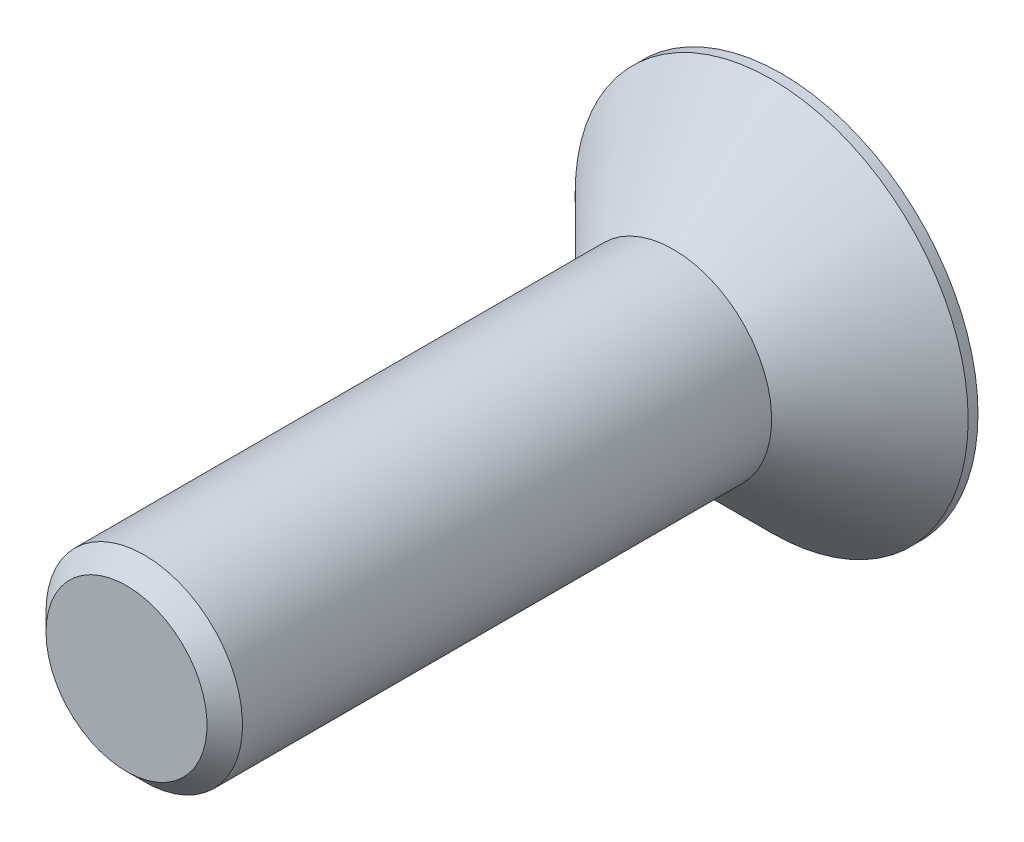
ISO-10303-21;
HEADER;
FILE_DESCRIPTION(('STEP AP214'),'2;1');
FILE_NAME('part.step','',(''),(''),'','','');
FILE_SCHEMA(('AUTOMOTIVE_DESIGN { 1 0 10303 214 1 1 1 1 }'));
ENDSEC;
DATA;
#1=APPLICATION_CONTEXT('core data for automotive mechanical design processes');
#2=APPLICATION_PROTOCOL_DEFINITION('international standard','automotive_design',2000,#1);
#3=PRODUCT_CONTEXT('',#1,'mechanical');
#4=PRODUCT('Part','Part','',(#3));
#5=PRODUCT_RELATED_PRODUCT_CATEGORY('part','',(#4));
#6=PRODUCT_DEFINITION_FORMATION('','',#4);
#7=PRODUCT_DEFINITION_CONTEXT('part definition',#1,'design');
#8=PRODUCT_DEFINITION('design','',#6,#7);
#9=PRODUCT_DEFINITION_SHAPE('','',#8);
#10=(LENGTH_UNIT() NAMED_UNIT(*) SI_UNIT(.MILLI.,.METRE.));
#11=(NAMED_UNIT(*) PLANE_ANGLE_UNIT() SI_UNIT($,.RADIAN.));
#12=(NAMED_UNIT(*) SI_UNIT($,.STERADIAN.) SOLID_ANGLE_UNIT());
#13=UNCERTAINTY_MEASURE_WITH_UNIT(LENGTH_MEASURE(1.E-05),#10,'distance_accuracy_value','');
#14=(GEOMETRIC_REPRESENTATION_CONTEXT(3) GLOBAL_UNCERTAINTY_ASSIGNED_CONTEXT((#13)) GLOBAL_UNIT_ASSIGNED_CONTEXT((#10,
#11,#12)) REPRESENTATION_CONTEXT('',''));
#15=CARTESIAN_POINT('',(0.,0.,0.));
#16=DIRECTION('',(0.,0.,1.));
#17=DIRECTION('',(1.,0.,0.));
#18=AXIS2_PLACEMENT_3D('',#15,#16,#17);
#19=CARTESIAN_POINT('',(0.,-2.45849999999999,20.));
#20=DIRECTION('',(0.,0.,-1.));
#21=DIRECTION('',(0.,1.,0.));
#22=AXIS2_PLACEMENT_3D('',#19,#20,#21);
#23=PLANE('',#22);
#24=CARTESIAN_POINT('',(0.,0.,19.9999999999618));
#25=DIRECTION('',(0.,0.,-1.));
#26=DIRECTION('',(-1.,0.,0.));
#27=AXIS2_PLACEMENT_3D('',#24,#25,#26);
#28=CIRCLE('',#27,2.45850000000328);
#29=CARTESIAN_POINT('',(-2.45850000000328,0.,19.9999999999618));
#30=VERTEX_POINT('',#29);
#31=EDGE_CURVE('E20',#30,#30,#28,.T.);
#32=ORIENTED_EDGE('',*,*,#31,.F.);
#33=EDGE_LOOP('',(#32));
#34=FACE_BOUND('',#33,.T.);
#35=ADVANCED_FACE('F16',(#34),#23,.F.);
#36=CARTESIAN_POINT('',(0.,0.,19.4585000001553));
#37=DIRECTION('',(0.,0.,-1.));
#38=DIRECTION('',(-1.,0.,0.));
#39=AXIS2_PLACEMENT_3D('',#36,#37,#38);
#40=CONICAL_SURFACE('',#39,2.99999999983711,0.785398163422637);
#41=ORIENTED_EDGE('',*,*,#31,.T.);
#42=EDGE_LOOP('',(#41));
#43=FACE_BOUND('',#42,.T.);
#44=CARTESIAN_POINT('',(0.,0.,19.4585));
#45=DIRECTION('',(0.,0.,-1.));
#46=DIRECTION('',(0.,1.,0.));
#47=AXIS2_PLACEMENT_3D('',#44,#45,#46);
#48=CIRCLE('',#47,3.);
#49=CARTESIAN_POINT('',(0.,3.00000000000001,19.4585));
#50=VERTEX_POINT('',#49);
#51=EDGE_CURVE('E129',#50,#50,#48,.T.);
#52=ORIENTED_EDGE('',*,*,#51,.F.);
#53=EDGE_LOOP('',(#52));
#54=FACE_BOUND('',#53,.T.);
#55=ADVANCED_FACE('F190',(#43,#54),#40,.T.);
#56=CARTESIAN_POINT('',(0.,0.,10.));
#57=DIRECTION('',(0.,0.,-1.));
#58=DIRECTION('',(0.,1.,0.));
#59=AXIS2_PLACEMENT_3D('',#56,#57,#58);
#60=CYLINDRICAL_SURFACE('',#59,3.);
#61=ORIENTED_EDGE('',*,*,#51,.T.);
#62=EDGE_LOOP('',(#61));
#63=FACE_BOUND('',#62,.T.);
#64=CARTESIAN_POINT('',(0.,0.,3.30000000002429));
#65=DIRECTION('',(0.,0.,-1.));
#66=DIRECTION('',(-0.479425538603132,-0.877582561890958,0.));
#67=AXIS2_PLACEMENT_3D('',#64,#65,#66);
#68=CIRCLE('',#67,3.00000000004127);
#69=CARTESIAN_POINT('',(-1.4382766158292,-2.63274768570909,3.3000000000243));
#70=VERTEX_POINT('',#69);
#71=EDGE_CURVE('E126',#70,#70,#68,.T.);
#72=ORIENTED_EDGE('',*,*,#71,.F.);
#73=EDGE_LOOP('',(#72));
#74=FACE_BOUND('',#73,.T.);
#75=ADVANCED_FACE('F186',(#63,#74),#60,.T.);
#76=CARTESIAN_POINT('',(0.,0.,0.299999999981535));
#77=DIRECTION('',(0.,0.,-1.));
#78=DIRECTION('',(0.,1.,0.));
#79=AXIS2_PLACEMENT_3D('',#76,#77,#78);
#80=CONICAL_SURFACE('',#79,6.00000000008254,0.785398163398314);
#81=ORIENTED_EDGE('',*,*,#71,.T.);
#82=EDGE_LOOP('',(#81));
#83=FACE_BOUND('',#82,.T.);
#84=CARTESIAN_POINT('',(0.,0.,0.299999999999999));
#85=DIRECTION('',(0.,0.,-1.));
#86=DIRECTION('',(0.,1.,0.));
#87=AXIS2_PLACEMENT_3D('',#84,#85,#86);
#88=CIRCLE('',#87,6.);
#89=CARTESIAN_POINT('',(0.,6.,0.299999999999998));
#90=VERTEX_POINT('',#89);
#91=EDGE_CURVE('E83',#90,#90,#88,.T.);
#92=ORIENTED_EDGE('',*,*,#91,.F.);
#93=EDGE_LOOP('',(#92));
#94=FACE_BOUND('',#93,.T.);
#95=ADVANCED_FACE('F145',(#83,#94),#80,.T.);
#96=CARTESIAN_POINT('',(0.,0.,2.8));
#97=DIRECTION('',(0.,0.,-1.));
#98=DIRECTION('',(0.,1.,0.));
#99=AXIS2_PLACEMENT_3D('',#96,#97,#98);
#100=PLANE('',#99);
#101=DIRECTION('',(0.50000000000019,-0.866025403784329,0.));
#102=VECTOR('',#101,1.);
#103=CARTESIAN_POINT('',(1.15470053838,2.00000000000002,2.79999999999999));
#104=LINE('',#103,#102);
#105=CARTESIAN_POINT('',(2.30940107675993,0.,2.79999999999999));
#106=VERTEX_POINT('',#105);
#107=CARTESIAN_POINT('',(1.15470053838,2.00000000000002,2.79999999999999));
#108=VERTEX_POINT('',#107);
#109=EDGE_CURVE('E74',#106,#108,#104,.F.);
#110=ORIENTED_EDGE('',*,*,#109,.F.);
#111=DIRECTION('',(-0.50000000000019,-0.866025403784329,0.));
#112=VECTOR('',#111,1.);
#113=CARTESIAN_POINT('',(2.30940107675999,0.,2.79999999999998));
#114=LINE('',#113,#112);
#115=CARTESIAN_POINT('',(1.15470053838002,-2.00000000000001,2.79999999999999));
#116=VERTEX_POINT('',#115);
#117=EDGE_CURVE('E109',#116,#106,#114,.F.);
#118=ORIENTED_EDGE('',*,*,#117,.F.);
#119=DIRECTION('',(1.,0.,0.));
#120=VECTOR('',#119,1.);
#121=CARTESIAN_POINT('',(1.15470053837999,-2.,2.79999999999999));
#122=LINE('',#121,#120);
#123=CARTESIAN_POINT('',(-1.15470053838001,-1.99999999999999,2.79999999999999));
#124=VERTEX_POINT('',#123);
#125=EDGE_CURVE('E59',#124,#116,#122,.T.);
#126=ORIENTED_EDGE('',*,*,#125,.F.);
#127=DIRECTION('',(-0.50000000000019,0.866025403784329,0.));
#128=VECTOR('',#127,1.);
#129=CARTESIAN_POINT('',(-1.15470053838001,-1.99999999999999,2.79999999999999));
#130=LINE('',#129,#128);
#131=CARTESIAN_POINT('',(-2.30940107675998,0.,2.80000000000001));
#132=VERTEX_POINT('',#131);
#133=EDGE_CURVE('E102',#132,#124,#130,.F.);
#134=ORIENTED_EDGE('',*,*,#133,.F.);
#135=DIRECTION('',(0.50000000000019,0.866025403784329,0.));
#136=VECTOR('',#135,1.);
#137=CARTESIAN_POINT('',(-2.30940107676,0.,2.79999999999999));
#138=LINE('',#137,#136);
#139=CARTESIAN_POINT('',(-1.15470053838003,2.00000000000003,2.79999999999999));
#140=VERTEX_POINT('',#139);
#141=EDGE_CURVE('E89',#140,#132,#138,.F.);
#142=ORIENTED_EDGE('',*,*,#141,.F.);
#143=DIRECTION('',(1.,0.,0.));
#144=VECTOR('',#143,1.);
#145=CARTESIAN_POINT('',(-1.15470053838,2.00000000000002,2.79999999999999));
#146=LINE('',#145,#144);
#147=EDGE_CURVE('E86',#108,#140,#146,.F.);
#148=ORIENTED_EDGE('',*,*,#147,.F.);
#149=EDGE_LOOP('',(#110,#118,#126,#134,#142,#148));
#150=FACE_BOUND('',#149,.T.);
#151=ADVANCED_FACE('F87',(#150),#100,.T.);
#152=CARTESIAN_POINT('',(0.,0.,10.));
#153=DIRECTION('',(0.,0.,-1.));
#154=DIRECTION('',(0.,1.,0.));
#155=AXIS2_PLACEMENT_3D('',#152,#153,#154);
#156=CYLINDRICAL_SURFACE('',#155,6.);
#157=ORIENTED_EDGE('',*,*,#91,.T.);
#158=EDGE_LOOP('',(#157));
#159=FACE_BOUND('',#158,.T.);
#160=CARTESIAN_POINT('',(0.,0.,0.));
#161=DIRECTION('',(0.,0.,-1.));
#162=DIRECTION('',(0.,1.,0.));
#163=AXIS2_PLACEMENT_3D('',#160,#161,#162);
#164=CIRCLE('',#163,6.);
#165=CARTESIAN_POINT('',(0.,6.,0.));
#166=VERTEX_POINT('',#165);
#167=EDGE_CURVE('E111',#166,#166,#164,.T.);
#168=ORIENTED_EDGE('',*,*,#167,.F.);
#169=EDGE_LOOP('',(#168));
#170=FACE_BOUND('',#169,.T.);
#171=ADVANCED_FACE('F135',(#159,#170),#156,.T.);
#172=CARTESIAN_POINT('',(1.15470053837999,2.00000000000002,0.));
#173=DIRECTION('',(-0.866025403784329,-0.50000000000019,0.));
#174=DIRECTION('',(0.50000000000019,-0.866025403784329,0.));
#175=AXIS2_PLACEMENT_3D('',#172,#173,#174);
#176=PLANE('',#175);
#177=DIRECTION('',(0.,0.,1.));
#178=VECTOR('',#177,1.);
#179=CARTESIAN_POINT('',(2.30940107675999,0.,0.));
#180=LINE('',#179,#178);
#181=CARTESIAN_POINT('',(2.30940107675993,0.,0.));
#182=VERTEX_POINT('',#181);
#183=EDGE_CURVE('E80',#106,#182,#180,.F.);
#184=ORIENTED_EDGE('',*,*,#183,.F.);
#185=ORIENTED_EDGE('',*,*,#109,.T.);
#186=DIRECTION('',(0.,0.,-1.));
#187=VECTOR('',#186,1.);
#188=CARTESIAN_POINT('',(1.15470053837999,2.00000000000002,0.));
#189=LINE('',#188,#187);
#190=CARTESIAN_POINT('',(1.15470053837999,2.00000000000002,0.));
#191=VERTEX_POINT('',#190);
#192=EDGE_CURVE('E78',#191,#108,#189,.F.);
#193=ORIENTED_EDGE('',*,*,#192,.F.);
#194=DIRECTION('',(-0.500000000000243,0.866025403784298,0.));
#195=VECTOR('',#194,1.);
#196=CARTESIAN_POINT('',(2.30940107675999,0.,0.));
#197=LINE('',#196,#195);
#198=EDGE_CURVE('E55',#182,#191,#197,.T.);
#199=ORIENTED_EDGE('',*,*,#198,.F.);
#200=EDGE_LOOP('',(#184,#185,#193,#199));
#201=FACE_BOUND('',#200,.T.);
#202=ADVANCED_FACE('F76',(#201),#176,.T.);
#203=CARTESIAN_POINT('',(-1.15470053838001,2.00000000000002,0.));
#204=DIRECTION('',(0.,-1.,0.));
#205=DIRECTION('',(0.,0.,-1.));
#206=AXIS2_PLACEMENT_3D('',#203,#204,#205);
#207=PLANE('',#206);
#208=ORIENTED_EDGE('',*,*,#192,.T.);
#209=ORIENTED_EDGE('',*,*,#147,.T.);
#210=DIRECTION('',(0.,0.,1.));
#211=VECTOR('',#210,1.);
#212=CARTESIAN_POINT('',(-1.15470053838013,2.00000000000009,0.));
#213=LINE('',#212,#211);
#214=CARTESIAN_POINT('',(-1.15470053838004,2.00000000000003,0.));
#215=VERTEX_POINT('',#214);
#216=EDGE_CURVE('E92',#215,#140,#213,.T.);
#217=ORIENTED_EDGE('',*,*,#216,.F.);
#218=DIRECTION('',(1.,0.,0.));
#219=VECTOR('',#218,1.);
#220=CARTESIAN_POINT('',(0.,2.00000000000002,0.));
#221=LINE('',#220,#219);
#222=EDGE_CURVE('E96',#191,#215,#221,.F.);
#223=ORIENTED_EDGE('',*,*,#222,.F.);
#224=EDGE_LOOP('',(#208,#209,#217,#223));
#225=FACE_BOUND('',#224,.T.);
#226=ADVANCED_FACE('F94',(#225),#207,.T.);
#227=CARTESIAN_POINT('',(-2.30940107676,0.,0.));
#228=DIRECTION('',(0.866025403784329,-0.50000000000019,0.));
#229=DIRECTION('',(0.50000000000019,0.866025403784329,0.));
#230=AXIS2_PLACEMENT_3D('',#227,#228,#229);
#231=PLANE('',#230);
#232=ORIENTED_EDGE('',*,*,#216,.T.);
#233=ORIENTED_EDGE('',*,*,#141,.T.);
#234=DIRECTION('',(0.,0.,1.));
#235=VECTOR('',#234,1.);
#236=CARTESIAN_POINT('',(-2.30940107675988,0.,0.));
#237=LINE('',#236,#235);
#238=CARTESIAN_POINT('',(-2.30940107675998,0.,0.));
#239=VERTEX_POINT('',#238);
#240=EDGE_CURVE('E100',#239,#132,#237,.T.);
#241=ORIENTED_EDGE('',*,*,#240,.F.);
#242=DIRECTION('',(-0.500000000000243,-0.866025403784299,0.));
#243=VECTOR('',#242,1.);
#244=CARTESIAN_POINT('',(-1.15470053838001,2.00000000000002,0.));
#245=LINE('',#244,#243);
#246=EDGE_CURVE('E119',#215,#239,#245,.T.);
#247=ORIENTED_EDGE('',*,*,#246,.F.);
#248=EDGE_LOOP('',(#232,#233,#241,#247));
#249=FACE_BOUND('',#248,.T.);
#250=ADVANCED_FACE('F160',(#249),#231,.T.);
#251=CARTESIAN_POINT('',(-1.15470053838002,-2.,0.));
#252=DIRECTION('',(0.866025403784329,0.50000000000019,0.));
#253=DIRECTION('',(-0.50000000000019,0.866025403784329,0.));
#254=AXIS2_PLACEMENT_3D('',#251,#252,#253);
#255=PLANE('',#254);
#256=ORIENTED_EDGE('',*,*,#240,.T.);
#257=ORIENTED_EDGE('',*,*,#133,.T.);
#258=DIRECTION('',(0.,0.,1.));
#259=VECTOR('',#258,1.);
#260=CARTESIAN_POINT('',(-1.15470053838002,-2.,0.));
#261=LINE('',#260,#259);
#262=CARTESIAN_POINT('',(-1.15470053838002,-2.,0.));
#263=VERTEX_POINT('',#262);
#264=EDGE_CURVE('E104',#263,#124,#261,.T.);
#265=ORIENTED_EDGE('',*,*,#264,.F.);
#266=DIRECTION('',(0.500000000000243,-0.866025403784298,0.));
#267=VECTOR('',#266,1.);
#268=CARTESIAN_POINT('',(-2.30940107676,0.,0.));
#269=LINE('',#268,#267);
#270=EDGE_CURVE('E116',#239,#263,#269,.T.);
#271=ORIENTED_EDGE('',*,*,#270,.F.);
#272=EDGE_LOOP('',(#256,#257,#265,#271));
#273=FACE_BOUND('',#272,.T.);
#274=ADVANCED_FACE('F157',(#273),#255,.T.);
#275=CARTESIAN_POINT('',(1.15470053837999,-1.99999999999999,0.));
#276=DIRECTION('',(0.,1.,0.));
#277=DIRECTION('',(0.,0.,1.));
#278=AXIS2_PLACEMENT_3D('',#275,#276,#277);
#279=PLANE('',#278);
#280=ORIENTED_EDGE('',*,*,#264,.T.);
#281=ORIENTED_EDGE('',*,*,#125,.T.);
#282=DIRECTION('',(0.,0.,1.));
#283=VECTOR('',#282,1.);
#284=CARTESIAN_POINT('',(1.15470053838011,-2.00000000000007,0.));
#285=LINE('',#284,#283);
#286=CARTESIAN_POINT('',(1.15470053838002,-2.00000000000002,0.));
#287=VERTEX_POINT('',#286);
#288=EDGE_CURVE('E35',#287,#116,#285,.T.);
#289=ORIENTED_EDGE('',*,*,#288,.F.);
#290=DIRECTION('',(1.,0.,0.));
#291=VECTOR('',#290,1.);
#292=CARTESIAN_POINT('',(0.,-1.99999999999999,0.));
#293=LINE('',#292,#291);
#294=EDGE_CURVE('E26',#263,#287,#293,.T.);
#295=ORIENTED_EDGE('',*,*,#294,.F.);
#296=EDGE_LOOP('',(#280,#281,#289,#295));
#297=FACE_BOUND('',#296,.T.);
#298=ADVANCED_FACE('F153',(#297),#279,.T.);
#299=CARTESIAN_POINT('',(2.30940107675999,0.,0.));
#300=DIRECTION('',(-0.866025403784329,0.50000000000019,0.));
#301=DIRECTION('',(-0.50000000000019,-0.866025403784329,0.));
#302=AXIS2_PLACEMENT_3D('',#299,#300,#301);
#303=PLANE('',#302);
#304=ORIENTED_EDGE('',*,*,#288,.T.);
#305=ORIENTED_EDGE('',*,*,#117,.T.);
#306=ORIENTED_EDGE('',*,*,#183,.T.);
#307=DIRECTION('',(0.500000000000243,0.866025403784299,0.));
#308=VECTOR('',#307,1.);
#309=CARTESIAN_POINT('',(1.15470053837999,-1.99999999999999,0.));
#310=LINE('',#309,#308);
#311=EDGE_CURVE('E11',#287,#182,#310,.T.);
#312=ORIENTED_EDGE('',*,*,#311,.F.);
#313=EDGE_LOOP('',(#304,#305,#306,#312));
#314=FACE_BOUND('',#313,.T.);
#315=ADVANCED_FACE('F148',(#314),#303,.T.);
#316=CARTESIAN_POINT('',(0.,0.,0.));
#317=DIRECTION('',(0.,0.,-1.));
#318=DIRECTION('',(0.,1.,0.));
#319=AXIS2_PLACEMENT_3D('',#316,#317,#318);
#320=PLANE('',#319);
#321=ORIENTED_EDGE('',*,*,#294,.T.);
#322=ORIENTED_EDGE('',*,*,#311,.T.);
#323=ORIENTED_EDGE('',*,*,#198,.T.);
#324=ORIENTED_EDGE('',*,*,#222,.T.);
#325=ORIENTED_EDGE('',*,*,#246,.T.);
#326=ORIENTED_EDGE('',*,*,#270,.T.);
#327=EDGE_LOOP('',(#321,#322,#323,#324,#325,#326));
#328=FACE_BOUND('',#327,.T.);
#329=ORIENTED_EDGE('',*,*,#167,.T.);
#330=EDGE_LOOP('',(#329));
#331=FACE_BOUND('',#330,.T.);
#332=ADVANCED_FACE('F18',(#328,#331),#320,.T.);
#333=CLOSED_SHELL('',(#35,#55,#75,#95,#151,#171,#202,#226,#250,#274,#298,#315,#332));
#334=MANIFOLD_SOLID_BREP('B1',#333);
#335=ADVANCED_BREP_SHAPE_REPRESENTATION('',(#18,#334),#14);
#336=SHAPE_DEFINITION_REPRESENTATION(#9,#335);
ENDSEC;
END-ISO-10303-21;
